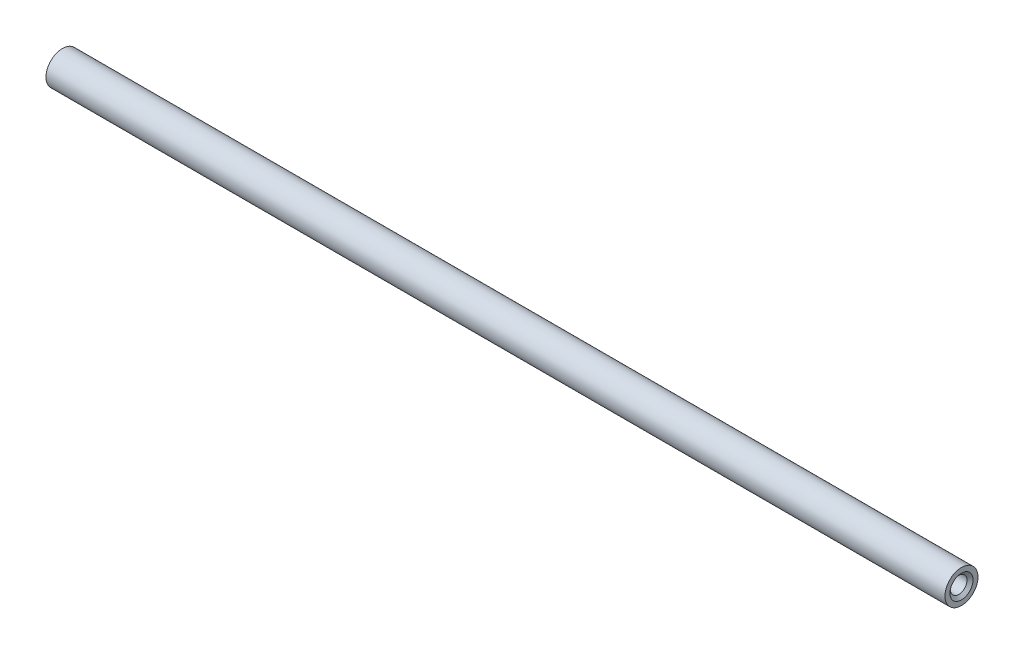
ISO-10303-21;
HEADER;
FILE_DESCRIPTION(('STEP AP214'),'2;1');
FILE_NAME('part.step','',(''),(''),'','','');
FILE_SCHEMA(('AUTOMOTIVE_DESIGN { 1 0 10303 214 1 1 1 1 }'));
ENDSEC;
DATA;
#1=APPLICATION_CONTEXT('core data for automotive mechanical design processes');
#2=APPLICATION_PROTOCOL_DEFINITION('international standard','automotive_design',2000,#1);
#3=PRODUCT_CONTEXT('',#1,'mechanical');
#4=PRODUCT('Part','Part','',(#3));
#5=PRODUCT_RELATED_PRODUCT_CATEGORY('part','',(#4));
#6=PRODUCT_DEFINITION_FORMATION('','',#4);
#7=PRODUCT_DEFINITION_CONTEXT('part definition',#1,'design');
#8=PRODUCT_DEFINITION('design','',#6,#7);
#9=PRODUCT_DEFINITION_SHAPE('','',#8);
#10=(LENGTH_UNIT() NAMED_UNIT(*) SI_UNIT(.MILLI.,.METRE.));
#11=(NAMED_UNIT(*) PLANE_ANGLE_UNIT() SI_UNIT($,.RADIAN.));
#12=(NAMED_UNIT(*) SI_UNIT($,.STERADIAN.) SOLID_ANGLE_UNIT());
#13=UNCERTAINTY_MEASURE_WITH_UNIT(LENGTH_MEASURE(1.E-05),#10,'distance_accuracy_value','');
#14=(GEOMETRIC_REPRESENTATION_CONTEXT(3) GLOBAL_UNCERTAINTY_ASSIGNED_CONTEXT((#13)) GLOBAL_UNIT_ASSIGNED_CONTEXT((#10,
#11,#12)) REPRESENTATION_CONTEXT('',''));
#15=CARTESIAN_POINT('',(0.,0.,0.));
#16=DIRECTION('',(0.,0.,1.));
#17=DIRECTION('',(1.,0.,0.));
#18=AXIS2_PLACEMENT_3D('',#15,#16,#17);
#19=CARTESIAN_POINT('',(0.,0.,0.));
#20=DIRECTION('',(-1.,0.,0.));
#21=DIRECTION('',(0.,0.,1.));
#22=AXIS2_PLACEMENT_3D('',#19,#20,#21);
#23=PLANE('',#22);
#24=CARTESIAN_POINT('',(0.,0.,-3.175));
#25=DIRECTION('',(1.,0.,0.));
#26=DIRECTION('',(0.,0.,-1.));
#27=AXIS2_PLACEMENT_3D('',#24,#25,#26);
#28=CIRCLE('',#27,2.2225);
#29=CARTESIAN_POINT('',(0.,0.,-5.3975));
#30=VERTEX_POINT('',#29);
#31=EDGE_CURVE('E66',#30,#30,#28,.T.);
#32=ORIENTED_EDGE('',*,*,#31,.F.);
#33=EDGE_LOOP('',(#32));
#34=FACE_BOUND('',#33,.T.);
#35=CARTESIAN_POINT('',(0.,0.,-3.175));
#36=DIRECTION('',(1.,0.,0.));
#37=DIRECTION('',(0.,0.,-1.));
#38=AXIS2_PLACEMENT_3D('',#35,#36,#37);
#39=CIRCLE('',#38,3.175);
#40=CARTESIAN_POINT('',(0.,0.,-6.35));
#41=VERTEX_POINT('',#40);
#42=EDGE_CURVE('E43',#41,#41,#39,.T.);
#43=ORIENTED_EDGE('',*,*,#42,.T.);
#44=EDGE_LOOP('',(#43));
#45=FACE_BOUND('',#44,.T.);
#46=ADVANCED_FACE('F36',(#34,#45),#23,.F.);
#47=CARTESIAN_POINT('',(-172.72,0.,0.));
#48=DIRECTION('',(1.,0.,0.));
#49=DIRECTION('',(0.,0.,-1.));
#50=AXIS2_PLACEMENT_3D('',#47,#48,#49);
#51=PLANE('',#50);
#52=CARTESIAN_POINT('',(-172.72,0.,-3.17499999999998));
#53=DIRECTION('',(-1.,0.,0.));
#54=DIRECTION('',(0.,0.,1.));
#55=AXIS2_PLACEMENT_3D('',#52,#53,#54);
#56=CIRCLE('',#55,2.2225);
#57=CARTESIAN_POINT('',(-172.72,0.,-0.95249999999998));
#58=VERTEX_POINT('',#57);
#59=EDGE_CURVE('E59',#58,#58,#56,.T.);
#60=ORIENTED_EDGE('',*,*,#59,.F.);
#61=EDGE_LOOP('',(#60));
#62=FACE_BOUND('',#61,.T.);
#63=CARTESIAN_POINT('',(-172.72,0.,-3.17499999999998));
#64=DIRECTION('',(1.,0.,0.));
#65=DIRECTION('',(0.,0.,-1.));
#66=AXIS2_PLACEMENT_3D('',#63,#64,#65);
#67=CIRCLE('',#66,3.175);
#68=CARTESIAN_POINT('',(-172.72,0.,-6.34999999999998));
#69=VERTEX_POINT('',#68);
#70=EDGE_CURVE('E11',#69,#69,#67,.T.);
#71=ORIENTED_EDGE('',*,*,#70,.F.);
#72=EDGE_LOOP('',(#71));
#73=FACE_BOUND('',#72,.T.);
#74=ADVANCED_FACE('F82',(#62,#73),#51,.F.);
#75=CARTESIAN_POINT('',(0.,0.,-3.175));
#76=DIRECTION('',(1.,0.,0.));
#77=DIRECTION('',(0.,0.,-1.));
#78=AXIS2_PLACEMENT_3D('',#75,#76,#77);
#79=CYLINDRICAL_SURFACE('',#78,3.175);
#80=ORIENTED_EDGE('',*,*,#42,.F.);
#81=EDGE_LOOP('',(#80));
#82=FACE_BOUND('',#81,.T.);
#83=ORIENTED_EDGE('',*,*,#70,.T.);
#84=EDGE_LOOP('',(#83));
#85=FACE_BOUND('',#84,.T.);
#86=ADVANCED_FACE('F78',(#82,#85),#79,.T.);
#87=CARTESIAN_POINT('',(-153.67,0.,-3.17499999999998));
#88=DIRECTION('',(-1.,0.,0.));
#89=DIRECTION('',(0.,0.,1.));
#90=AXIS2_PLACEMENT_3D('',#87,#88,#89);
#91=CONICAL_SURFACE('',#90,1.5875,1.02974425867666);
#92=CARTESIAN_POINT('',(-152.716133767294,0.,-3.17499999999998));
#93=VERTEX_POINT('',#92);
#94=VERTEX_LOOP('',#93);
#95=FACE_BOUND('',#94,.T.);
#96=CARTESIAN_POINT('',(-153.67,0.,-3.17499999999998));
#97=DIRECTION('',(-1.,0.,0.));
#98=DIRECTION('',(0.,0.,1.));
#99=AXIS2_PLACEMENT_3D('',#96,#97,#98);
#100=CIRCLE('',#99,1.5875);
#101=CARTESIAN_POINT('',(-153.67,0.,-1.58749999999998));
#102=VERTEX_POINT('',#101);
#103=EDGE_CURVE('E72',#102,#102,#100,.T.);
#104=ORIENTED_EDGE('',*,*,#103,.T.);
#105=EDGE_LOOP('',(#104));
#106=FACE_BOUND('',#105,.T.);
#107=ADVANCED_FACE('F81',(#95,#106),#91,.F.);
#108=CARTESIAN_POINT('',(-172.72,0.,-3.17499999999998));
#109=DIRECTION('',(-1.,0.,0.));
#110=DIRECTION('',(0.,0.,1.));
#111=AXIS2_PLACEMENT_3D('',#108,#109,#110);
#112=CYLINDRICAL_SURFACE('',#111,1.58749999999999);
#113=ORIENTED_EDGE('',*,*,#103,.F.);
#114=EDGE_LOOP('',(#113));
#115=FACE_BOUND('',#114,.T.);
#116=CARTESIAN_POINT('',(-172.187171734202,0.,-3.17499999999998));
#117=DIRECTION('',(-1.,0.,0.));
#118=DIRECTION('',(0.,0.,1.));
#119=AXIS2_PLACEMENT_3D('',#116,#117,#118);
#120=CIRCLE('',#119,1.58749999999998);
#121=CARTESIAN_POINT('',(-172.187171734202,0.,-1.5875));
#122=VERTEX_POINT('',#121);
#123=EDGE_CURVE('E63',#122,#122,#120,.T.);
#124=ORIENTED_EDGE('',*,*,#123,.T.);
#125=EDGE_LOOP('',(#124));
#126=FACE_BOUND('',#125,.T.);
#127=ADVANCED_FACE('F96',(#115,#126),#112,.F.);
#128=CARTESIAN_POINT('',(-172.72,0.,-3.17499999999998));
#129=DIRECTION('',(-1.,0.,0.));
#130=DIRECTION('',(0.,0.,1.));
#131=AXIS2_PLACEMENT_3D('',#128,#129,#130);
#132=CONICAL_SURFACE('',#131,2.2225,0.872664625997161);
#133=ORIENTED_EDGE('',*,*,#123,.F.);
#134=EDGE_LOOP('',(#133));
#135=FACE_BOUND('',#134,.T.);
#136=ORIENTED_EDGE('',*,*,#59,.T.);
#137=EDGE_LOOP('',(#136));
#138=FACE_BOUND('',#137,.T.);
#139=ADVANCED_FACE('F53',(#135,#138),#132,.F.);
#140=CARTESIAN_POINT('',(-19.05,0.,-3.175));
#141=DIRECTION('',(1.,0.,0.));
#142=DIRECTION('',(0.,0.,-1.));
#143=AXIS2_PLACEMENT_3D('',#140,#141,#142);
#144=CONICAL_SURFACE('',#143,1.5875,1.02974425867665);
#145=CARTESIAN_POINT('',(-20.0038662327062,0.,-3.175));
#146=VERTEX_POINT('',#145);
#147=VERTEX_LOOP('',#146);
#148=FACE_BOUND('',#147,.T.);
#149=CARTESIAN_POINT('',(-19.05,0.,-3.175));
#150=DIRECTION('',(1.,0.,0.));
#151=DIRECTION('',(0.,0.,-1.));
#152=AXIS2_PLACEMENT_3D('',#149,#150,#151);
#153=CIRCLE('',#152,1.5875);
#154=CARTESIAN_POINT('',(-19.05,0.,-4.76249999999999));
#155=VERTEX_POINT('',#154);
#156=EDGE_CURVE('E57',#155,#155,#153,.T.);
#157=ORIENTED_EDGE('',*,*,#156,.T.);
#158=EDGE_LOOP('',(#157));
#159=FACE_BOUND('',#158,.T.);
#160=ADVANCED_FACE('F49',(#148,#159),#144,.F.);
#161=CARTESIAN_POINT('',(0.,0.,-3.175));
#162=DIRECTION('',(1.,0.,0.));
#163=DIRECTION('',(0.,0.,-1.));
#164=AXIS2_PLACEMENT_3D('',#161,#162,#163);
#165=CYLINDRICAL_SURFACE('',#164,1.5875);
#166=ORIENTED_EDGE('',*,*,#156,.F.);
#167=EDGE_LOOP('',(#166));
#168=FACE_BOUND('',#167,.T.);
#169=CARTESIAN_POINT('',(-0.532828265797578,0.,-3.175));
#170=DIRECTION('',(1.,0.,0.));
#171=DIRECTION('',(0.,0.,-1.));
#172=AXIS2_PLACEMENT_3D('',#169,#170,#171);
#173=CIRCLE('',#172,1.5875);
#174=CARTESIAN_POINT('',(-0.532828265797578,0.,-4.7625));
#175=VERTEX_POINT('',#174);
#176=EDGE_CURVE('E60',#175,#175,#173,.T.);
#177=ORIENTED_EDGE('',*,*,#176,.T.);
#178=EDGE_LOOP('',(#177));
#179=FACE_BOUND('',#178,.T.);
#180=ADVANCED_FACE('F52',(#168,#179),#165,.F.);
#181=CARTESIAN_POINT('',(0.,0.,-3.175));
#182=DIRECTION('',(1.,0.,0.));
#183=DIRECTION('',(0.,0.,-1.));
#184=AXIS2_PLACEMENT_3D('',#181,#182,#183);
#185=CONICAL_SURFACE('',#184,2.2225,0.87266462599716);
#186=ORIENTED_EDGE('',*,*,#176,.F.);
#187=EDGE_LOOP('',(#186));
#188=FACE_BOUND('',#187,.T.);
#189=ORIENTED_EDGE('',*,*,#31,.T.);
#190=EDGE_LOOP('',(#189));
#191=FACE_BOUND('',#190,.T.);
#192=ADVANCED_FACE('F105',(#188,#191),#185,.F.);
#193=CLOSED_SHELL('',(#46,#74,#86,#107,#127,#139,#160,#180,#192));
#194=MANIFOLD_SOLID_BREP('B2',#193);
#195=ADVANCED_BREP_SHAPE_REPRESENTATION('',(#18,#194),#14);
#196=SHAPE_DEFINITION_REPRESENTATION(#9,#195);
ENDSEC;
END-ISO-10303-21;
